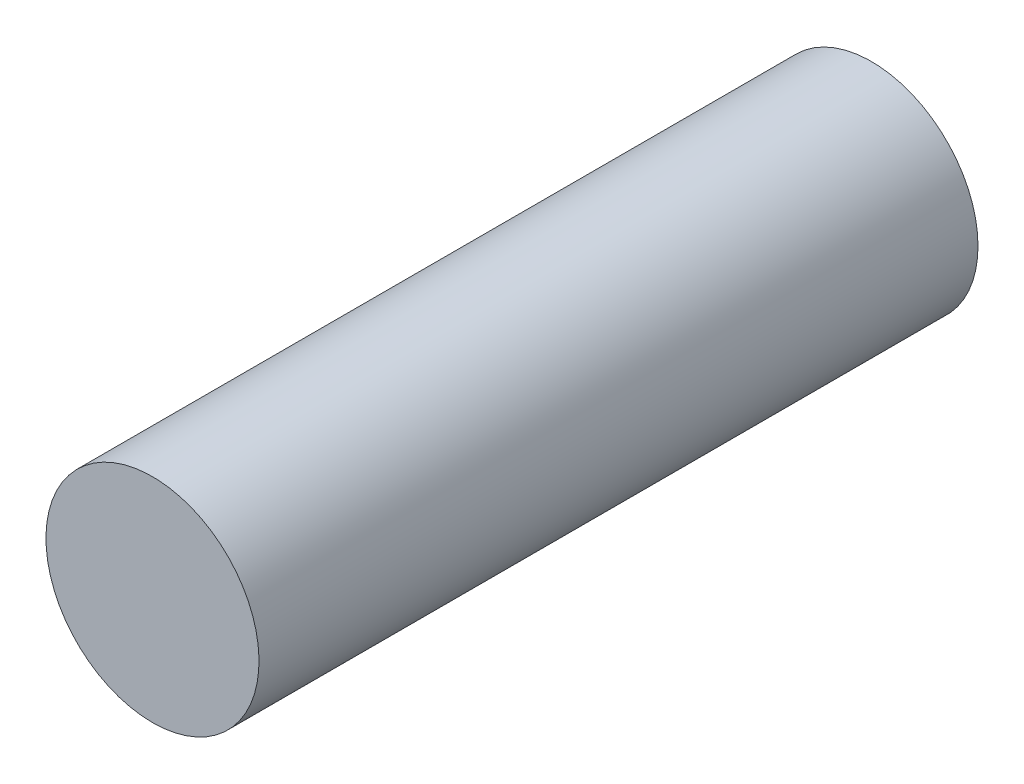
from build123d import *

# Parameters (mm, degrees)
ESQUISSE1_R        = 10
BOSS_EXTRU_1_DEPTH = 67.5


with BuildPart() as part:
    # Esquisse1 → Boss.-Extru.1 (new body)
    with BuildSketch(Plane.XY):
        with Locations(Location((43, 0, 0), (0, 0, 270))):
            Circle(ESQUISSE1_R)
    extrude(amount=BOSS_EXTRU_1_DEPTH)


solid = part.part
